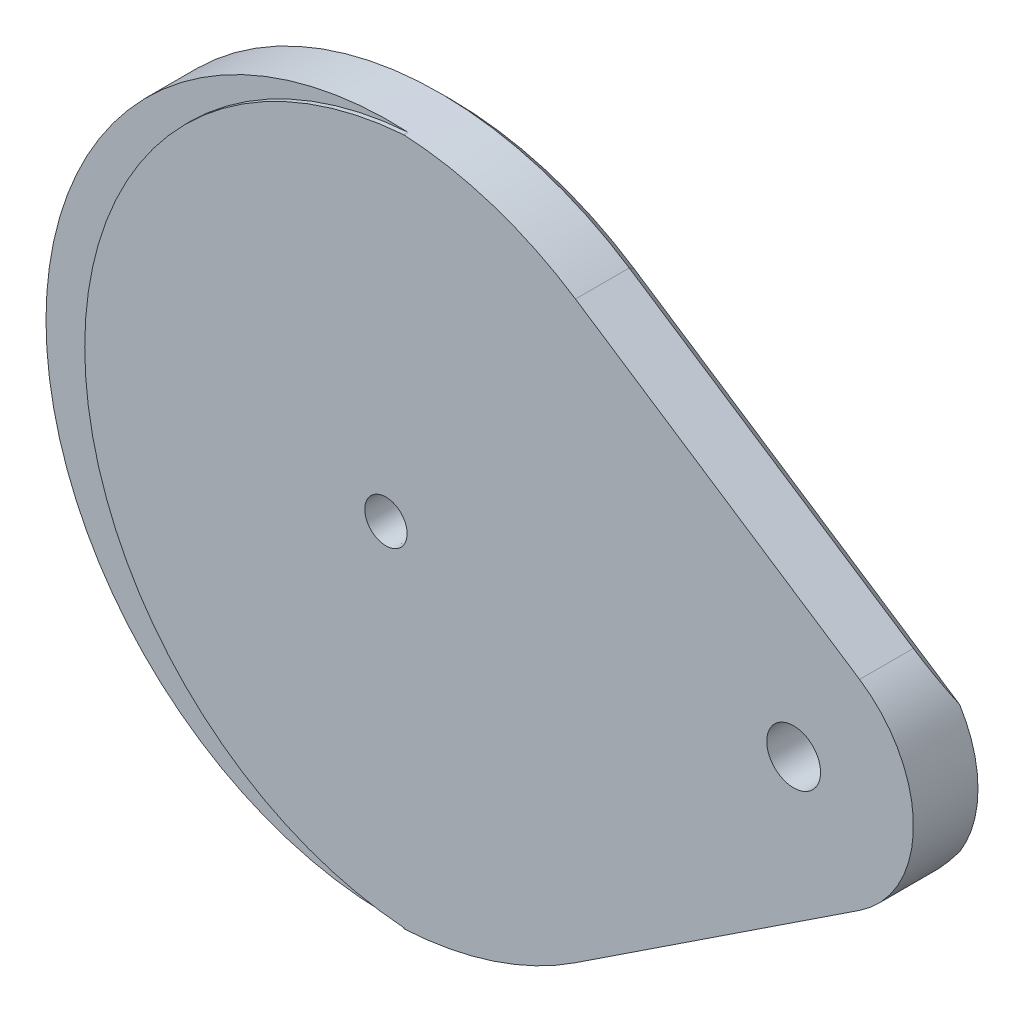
ISO-10303-21;
HEADER;
FILE_DESCRIPTION(('STEP AP214'),'2;1');
FILE_NAME('part.step','',(''),(''),'','','');
FILE_SCHEMA(('AUTOMOTIVE_DESIGN { 1 0 10303 214 1 1 1 1 }'));
ENDSEC;
DATA;
#1=APPLICATION_CONTEXT('core data for automotive mechanical design processes');
#2=APPLICATION_PROTOCOL_DEFINITION('international standard','automotive_design',2000,#1);
#3=PRODUCT_CONTEXT('',#1,'mechanical');
#4=PRODUCT('Part','Part','',(#3));
#5=PRODUCT_RELATED_PRODUCT_CATEGORY('part','',(#4));
#6=PRODUCT_DEFINITION_FORMATION('','',#4);
#7=PRODUCT_DEFINITION_CONTEXT('part definition',#1,'design');
#8=PRODUCT_DEFINITION('design','',#6,#7);
#9=PRODUCT_DEFINITION_SHAPE('','',#8);
#10=(LENGTH_UNIT() NAMED_UNIT(*) SI_UNIT(.MILLI.,.METRE.));
#11=(NAMED_UNIT(*) PLANE_ANGLE_UNIT() SI_UNIT($,.RADIAN.));
#12=(NAMED_UNIT(*) SI_UNIT($,.STERADIAN.) SOLID_ANGLE_UNIT());
#13=UNCERTAINTY_MEASURE_WITH_UNIT(LENGTH_MEASURE(1.E-05),#10,'distance_accuracy_value','');
#14=(GEOMETRIC_REPRESENTATION_CONTEXT(3) GLOBAL_UNCERTAINTY_ASSIGNED_CONTEXT((#13)) GLOBAL_UNIT_ASSIGNED_CONTEXT((#10,
#11,#12)) REPRESENTATION_CONTEXT('',''));
#15=CARTESIAN_POINT('',(0.,0.,0.));
#16=DIRECTION('',(0.,0.,1.));
#17=DIRECTION('',(1.,0.,0.));
#18=AXIS2_PLACEMENT_3D('',#15,#16,#17);
#19=CARTESIAN_POINT('',(0.,0.,0.));
#20=DIRECTION('',(0.,0.,1.));
#21=DIRECTION('',(1.,0.,0.));
#22=AXIS2_PLACEMENT_3D('',#19,#20,#21);
#23=PLANE('',#22);
#24=CARTESIAN_POINT('',(0.,0.,0.));
#25=DIRECTION('',(0.,0.,-1.));
#26=DIRECTION('',(-1.,0.,0.));
#27=AXIS2_PLACEMENT_3D('',#24,#25,#26);
#28=CIRCLE('',#27,82.55);
#29=CARTESIAN_POINT('',(-82.55,0.,0.));
#30=VERTEX_POINT('',#29);
#31=EDGE_CURVE('E378',#30,#30,#28,.T.);
#32=ORIENTED_EDGE('',*,*,#31,.F.);
#33=EDGE_LOOP('',(#32));
#34=FACE_BOUND('',#33,.T.);
#35=DIRECTION('',(0.834795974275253,0.550559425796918,0.));
#36=VECTOR('',#35,1.);
#37=CARTESIAN_POINT('',(54.1888114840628,-82.164793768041,0.));
#38=LINE('',#37,#36);
#39=CARTESIAN_POINT('',(54.1888114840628,-82.164793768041,0.));
#40=VERTEX_POINT('',#39);
#41=CARTESIAN_POINT('',(150.262212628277,-18.8030644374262,0.));
#42=VERTEX_POINT('',#41);
#43=EDGE_CURVE('E186',#40,#42,#38,.T.);
#44=ORIENTED_EDGE('',*,*,#43,.F.);
#45=CARTESIAN_POINT('',(0.,0.,0.));
#46=DIRECTION('',(0.,0.,1.));
#47=DIRECTION('',(1.,0.,0.));
#48=AXIS2_PLACEMENT_3D('',#45,#46,#47);
#49=CIRCLE('',#48,98.425);
#50=CARTESIAN_POINT('',(54.1888114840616,82.1647937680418,0.));
#51=VERTEX_POINT('',#50);
#52=EDGE_CURVE('E180',#51,#40,#49,.T.);
#53=ORIENTED_EDGE('',*,*,#52,.F.);
#54=DIRECTION('',(0.834795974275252,-0.550559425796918,0.));
#55=VECTOR('',#54,1.);
#56=CARTESIAN_POINT('',(165.35578994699,8.8486426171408,0.));
#57=LINE('',#56,#55);
#58=CARTESIAN_POINT('',(150.262212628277,18.8030644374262,0.));
#59=VERTEX_POINT('',#58);
#60=EDGE_CURVE('E165',#51,#59,#57,.T.);
#61=ORIENTED_EDGE('',*,*,#60,.T.);
#62=CARTESIAN_POINT('',(120.3198,0.,0.));
#63=DIRECTION('',(0.,0.,1.));
#64=DIRECTION('',(1.,0.,0.));
#65=AXIS2_PLACEMENT_3D('',#62,#63,#64);
#66=CIRCLE('',#65,35.3568);
#67=EDGE_CURVE('E225',#42,#59,#66,.T.);
#68=ORIENTED_EDGE('',*,*,#67,.F.);
#69=EDGE_LOOP('',(#44,#53,#61,#68));
#70=FACE_BOUND('',#69,.T.);
#71=DIRECTION('',(0.,1.,0.));
#72=VECTOR('',#71,1.);
#73=CARTESIAN_POINT('',(123.4948,-22.225,0.));
#74=LINE('',#73,#72);
#75=CARTESIAN_POINT('',(123.4948,19.05,0.));
#76=VERTEX_POINT('',#75);
#77=CARTESIAN_POINT('',(123.4948,7.27483891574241,0.));
#78=VERTEX_POINT('',#77);
#79=EDGE_CURVE('E64',#76,#78,#74,.F.);
#80=ORIENTED_EDGE('',*,*,#79,.F.);
#81=CARTESIAN_POINT('',(120.3198,19.05,0.));
#82=DIRECTION('',(0.,0.,1.));
#83=DIRECTION('',(1.,0.,0.));
#84=AXIS2_PLACEMENT_3D('',#81,#82,#83);
#85=CIRCLE('',#84,3.175);
#86=CARTESIAN_POINT('',(117.1448,19.05,0.));
#87=VERTEX_POINT('',#86);
#88=EDGE_CURVE('E11',#76,#87,#85,.T.);
#89=ORIENTED_EDGE('',*,*,#88,.T.);
#90=DIRECTION('',(0.,1.,0.));
#91=VECTOR('',#90,1.);
#92=CARTESIAN_POINT('',(117.1448,-22.225,0.));
#93=LINE('',#92,#91);
#94=CARTESIAN_POINT('',(117.1448,7.27483891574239,0.));
#95=VERTEX_POINT('',#94);
#96=EDGE_CURVE('E154',#95,#87,#93,.T.);
#97=ORIENTED_EDGE('',*,*,#96,.F.);
#98=CARTESIAN_POINT('',(120.3198,0.,0.));
#99=DIRECTION('',(0.,0.,1.));
#100=DIRECTION('',(1.,0.,0.));
#101=AXIS2_PLACEMENT_3D('',#98,#99,#100);
#102=CIRCLE('',#101,7.93750000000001);
#103=CARTESIAN_POINT('',(117.1448,-7.27483891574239,0.));
#104=VERTEX_POINT('',#103);
#105=EDGE_CURVE('E221',#95,#104,#102,.T.);
#106=ORIENTED_EDGE('',*,*,#105,.T.);
#107=CARTESIAN_POINT('',(117.1448,-19.05,0.));
#108=VERTEX_POINT('',#107);
#109=EDGE_CURVE('E56',#108,#104,#93,.T.);
#110=ORIENTED_EDGE('',*,*,#109,.F.);
#111=CARTESIAN_POINT('',(120.3198,-19.05,0.));
#112=DIRECTION('',(0.,0.,1.));
#113=DIRECTION('',(1.,0.,0.));
#114=AXIS2_PLACEMENT_3D('',#111,#112,#113);
#115=CIRCLE('',#114,3.175);
#116=CARTESIAN_POINT('',(123.4948,-19.05,0.));
#117=VERTEX_POINT('',#116);
#118=EDGE_CURVE('E49',#108,#117,#115,.T.);
#119=ORIENTED_EDGE('',*,*,#118,.T.);
#120=CARTESIAN_POINT('',(123.4948,-7.27483891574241,0.));
#121=VERTEX_POINT('',#120);
#122=EDGE_CURVE('E162',#121,#117,#74,.F.);
#123=ORIENTED_EDGE('',*,*,#122,.F.);
#124=EDGE_CURVE('E160',#121,#78,#102,.T.);
#125=ORIENTED_EDGE('',*,*,#124,.T.);
#126=EDGE_LOOP('',(#80,#89,#97,#106,#110,#119,#123,#125));
#127=FACE_BOUND('',#126,.T.);
#128=ADVANCED_FACE('F40',(#34,#70,#127),#23,.F.);
#129=CARTESIAN_POINT('',(120.3198,0.,19.05));
#130=DIRECTION('',(0.,0.,-1.));
#131=DIRECTION('',(-1.,0.,0.));
#132=AXIS2_PLACEMENT_3D('',#129,#130,#131);
#133=CYLINDRICAL_SURFACE('',#132,7.93750000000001);
#134=CARTESIAN_POINT('',(120.3198,0.,19.05));
#135=DIRECTION('',(0.,0.,1.));
#136=DIRECTION('',(1.,0.,0.));
#137=AXIS2_PLACEMENT_3D('',#134,#135,#136);
#138=CIRCLE('',#137,7.93750000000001);
#139=CARTESIAN_POINT('',(128.2573,0.,19.05));
#140=VERTEX_POINT('',#139);
#141=EDGE_CURVE('E222',#140,#140,#138,.T.);
#142=ORIENTED_EDGE('',*,*,#141,.T.);
#143=EDGE_LOOP('',(#142));
#144=FACE_BOUND('',#143,.T.);
#145=ORIENTED_EDGE('',*,*,#124,.F.);
#146=CARTESIAN_POINT('',(123.4948,-7.27483891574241,0.));
#147=CARTESIAN_POINT('',(123.494812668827,-7.27482137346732,0.0854167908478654));
#148=CARTESIAN_POINT('',(123.491353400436,-7.27634285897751,0.170823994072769));
#149=CARTESIAN_POINT('',(123.477590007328,-7.28233280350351,0.340949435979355));
#150=CARTESIAN_POINT('',(123.467288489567,-7.28680014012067,0.425667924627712));
#151=CARTESIAN_POINT('',(123.439993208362,-7.29852780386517,0.593481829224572));
#152=CARTESIAN_POINT('',(123.423025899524,-7.30577708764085,0.676582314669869));
#153=CARTESIAN_POINT('',(123.382589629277,-7.32282084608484,0.840899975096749));
#154=CARTESIAN_POINT('',(123.359120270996,-7.33261547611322,0.922117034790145));
#155=CARTESIAN_POINT('',(123.279328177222,-7.36535374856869,1.16194816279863));
#156=CARTESIAN_POINT('',(123.213566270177,-7.39167700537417,1.31707609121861));
#157=CARTESIAN_POINT('',(123.059002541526,-7.45033388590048,1.61416298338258));
#158=CARTESIAN_POINT('',(122.97017881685,-7.48267321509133,1.75610925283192));
#159=CARTESIAN_POINT('',(122.766642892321,-7.55175336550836,2.03082905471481));
#160=CARTESIAN_POINT('',(122.65083600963,-7.58863489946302,2.16275795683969));
#161=CARTESIAN_POINT('',(122.398943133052,-7.66147804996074,2.40592018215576));
#162=CARTESIAN_POINT('',(122.262852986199,-7.6974394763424,2.51714925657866));
#163=CARTESIAN_POINT('',(121.967634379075,-7.76610424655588,2.72003265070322));
#164=CARTESIAN_POINT('',(121.807808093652,-7.79862271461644,2.81073988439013));
#165=CARTESIAN_POINT('',(121.473633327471,-7.85501261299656,2.96361496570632));
#166=CARTESIAN_POINT('',(121.299290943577,-7.87888765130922,3.02579472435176));
#167=CARTESIAN_POINT('',(120.949985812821,-7.91429574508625,3.11680415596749));
#168=CARTESIAN_POINT('',(120.775461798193,-7.92637039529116,3.14710278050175));
#169=CARTESIAN_POINT('',(120.423413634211,-7.93877492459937,3.17822021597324));
#170=CARTESIAN_POINT('',(120.245890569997,-7.93910896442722,3.17904947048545));
#171=CARTESIAN_POINT('',(119.90350451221,-7.9283236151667,3.15200847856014));
#172=CARTESIAN_POINT('',(119.738490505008,-7.91784651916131,3.12574768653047));
#173=CARTESIAN_POINT('',(119.415441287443,-7.88748217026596,3.04801048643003));
#174=CARTESIAN_POINT('',(119.257406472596,-7.86759438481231,2.99653265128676));
#175=CARTESIAN_POINT('',(118.949950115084,-7.81997467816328,2.86918968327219));
#176=CARTESIAN_POINT('',(118.800694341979,-7.7921290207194,2.7929685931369));
#177=CARTESIAN_POINT('',(118.51670579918,-7.73135683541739,2.61863820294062));
#178=CARTESIAN_POINT('',(118.381978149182,-7.69842852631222,2.52052122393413));
#179=CARTESIAN_POINT('',(118.121487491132,-7.62828318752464,2.29767442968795));
#180=CARTESIAN_POINT('',(117.996891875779,-7.59092651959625,2.17162128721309));
#181=CARTESIAN_POINT('',(117.770119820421,-7.51779639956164,1.90028038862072));
#182=CARTESIAN_POINT('',(117.667953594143,-7.48202367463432,1.75498391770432));
#183=CARTESIAN_POINT('',(117.486203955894,-7.41514238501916,1.44383497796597));
#184=CARTESIAN_POINT('',(117.407354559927,-7.3841975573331,1.27751148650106));
#185=CARTESIAN_POINT('',(117.311344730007,-7.34535742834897,1.01897061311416));
#186=CARTESIAN_POINT('',(117.28305640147,-7.33367552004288,0.931303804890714));
#187=CARTESIAN_POINT('',(117.234141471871,-7.31322917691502,0.753538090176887));
#188=CARTESIAN_POINT('',(117.213511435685,-7.3044634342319,0.66344029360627));
#189=CARTESIAN_POINT('',(117.179569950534,-7.28994070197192,0.478275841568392));
#190=CARTESIAN_POINT('',(117.166547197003,-7.28430276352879,0.38314681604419));
#191=CARTESIAN_POINT('',(117.149154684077,-7.27673901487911,0.192016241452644));
#192=CARTESIAN_POINT('',(117.144779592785,-7.27481091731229,0.0960152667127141));
#193=CARTESIAN_POINT('',(117.1448,-7.27483891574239,0.));
#194=B_SPLINE_CURVE_WITH_KNOTS('',3,(#146,#147,#148,#149,#150,#151,#152,#153,#154,#155,#156,
#157,#158,#159,#160,#161,#162,#163,#164,#165,#166,#167,#168,#169,#170,#171,#172,#173,#174,#175,
#176,#177,#178,#179,#180,#181,#182,#183,#184,#185,#186,#187,#188,#189,#190,#191,#192,#193),
.UNSPECIFIED.,.F.,.F.,(4,2,2,2,2,2,2,2,2,2,2,2,2,2,2,2,2,2,2,2,2,2,2,4),(0.,0.256150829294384,
0.512204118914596,0.767251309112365,1.02231407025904,1.53143426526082,2.0410397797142,
2.57679901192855,3.11266809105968,3.66971038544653,4.22651988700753,4.75637028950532,
5.28603291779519,5.78594402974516,6.28588343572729,6.79335980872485,7.30101443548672,
7.84196226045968,8.3831559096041,8.93991483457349,9.21815697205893,9.49627415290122,
9.78435582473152,10.072259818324),.UNSPECIFIED.);
#195=EDGE_CURVE('E266',#121,#104,#194,.T.);
#196=ORIENTED_EDGE('',*,*,#195,.T.);
#197=ORIENTED_EDGE('',*,*,#105,.F.);
#198=CARTESIAN_POINT('',(117.1448,7.27483891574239,0.));
#199=CARTESIAN_POINT('',(117.144787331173,7.27482137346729,0.0854167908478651));
#200=CARTESIAN_POINT('',(117.148246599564,7.27634285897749,0.170823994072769));
#201=CARTESIAN_POINT('',(117.162009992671,7.28233280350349,0.340949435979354));
#202=CARTESIAN_POINT('',(117.172311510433,7.28680014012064,0.425667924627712));
#203=CARTESIAN_POINT('',(117.199606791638,7.29852780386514,0.593481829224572));
#204=CARTESIAN_POINT('',(117.216574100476,7.30577708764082,0.676582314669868));
#205=CARTESIAN_POINT('',(117.257010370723,7.32282084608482,0.840899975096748));
#206=CARTESIAN_POINT('',(117.280479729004,7.3326154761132,0.922117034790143));
#207=CARTESIAN_POINT('',(117.360271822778,7.36535374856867,1.16194816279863));
#208=CARTESIAN_POINT('',(117.426033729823,7.39167700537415,1.31707609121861));
#209=CARTESIAN_POINT('',(117.580597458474,7.45033388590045,1.61416298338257));
#210=CARTESIAN_POINT('',(117.66942118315,7.48267321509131,1.75610925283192));
#211=CARTESIAN_POINT('',(117.872957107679,7.55175336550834,2.03082905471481));
#212=CARTESIAN_POINT('',(117.98876399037,7.588634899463,2.16275795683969));
#213=CARTESIAN_POINT('',(118.240656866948,7.66147804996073,2.40592018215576));
#214=CARTESIAN_POINT('',(118.376747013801,7.69743947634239,2.51714925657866));
#215=CARTESIAN_POINT('',(118.671965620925,7.76610424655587,2.72003265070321));
#216=CARTESIAN_POINT('',(118.831791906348,7.79862271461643,2.81073988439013));
#217=CARTESIAN_POINT('',(119.165966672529,7.85501261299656,2.96361496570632));
#218=CARTESIAN_POINT('',(119.340309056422,7.87888765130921,3.02579472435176));
#219=CARTESIAN_POINT('',(119.689614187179,7.91429574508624,3.11680415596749));
#220=CARTESIAN_POINT('',(119.864138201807,7.92637039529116,3.14710278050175));
#221=CARTESIAN_POINT('',(120.216186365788,7.93877492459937,3.17822021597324));
#222=CARTESIAN_POINT('',(120.393709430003,7.93910896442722,3.17904947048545));
#223=CARTESIAN_POINT('',(120.73609548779,7.9283236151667,3.15200847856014));
#224=CARTESIAN_POINT('',(120.901109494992,7.91784651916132,3.12574768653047));
#225=CARTESIAN_POINT('',(121.224158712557,7.88748217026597,3.04801048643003));
#226=CARTESIAN_POINT('',(121.382193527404,7.86759438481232,2.99653265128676));
#227=CARTESIAN_POINT('',(121.689649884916,7.81997467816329,2.86918968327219));
#228=CARTESIAN_POINT('',(121.838905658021,7.79212902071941,2.79296859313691));
#229=CARTESIAN_POINT('',(122.12289420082,7.73135683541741,2.61863820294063));
#230=CARTESIAN_POINT('',(122.257621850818,7.69842852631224,2.52052122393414));
#231=CARTESIAN_POINT('',(122.518112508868,7.62828318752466,2.29767442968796));
#232=CARTESIAN_POINT('',(122.642708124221,7.59092651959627,2.1716212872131));
#233=CARTESIAN_POINT('',(122.869480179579,7.51779639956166,1.90028038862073));
#234=CARTESIAN_POINT('',(122.971646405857,7.48202367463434,1.75498391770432));
#235=CARTESIAN_POINT('',(123.153396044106,7.41514238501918,1.44383497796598));
#236=CARTESIAN_POINT('',(123.232245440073,7.38419755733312,1.27751148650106));
#237=CARTESIAN_POINT('',(123.328255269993,7.34535742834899,1.01897061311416));
#238=CARTESIAN_POINT('',(123.35654359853,7.3336755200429,0.931303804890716));
#239=CARTESIAN_POINT('',(123.405458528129,7.31322917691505,0.753538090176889));
#240=CARTESIAN_POINT('',(123.426088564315,7.30446343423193,0.663440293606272));
#241=CARTESIAN_POINT('',(123.460030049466,7.28994070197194,0.478275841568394));
#242=CARTESIAN_POINT('',(123.473052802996,7.28430276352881,0.383146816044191));
#243=CARTESIAN_POINT('',(123.490445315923,7.27673901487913,0.192016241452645));
#244=CARTESIAN_POINT('',(123.494820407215,7.27481091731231,0.0960152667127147));
#245=CARTESIAN_POINT('',(123.4948,7.27483891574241,0.));
#246=B_SPLINE_CURVE_WITH_KNOTS('',3,(#198,#199,#200,#201,#202,#203,#204,#205,#206,#207,#208,
#209,#210,#211,#212,#213,#214,#215,#216,#217,#218,#219,#220,#221,#222,#223,#224,#225,#226,#227,
#228,#229,#230,#231,#232,#233,#234,#235,#236,#237,#238,#239,#240,#241,#242,#243,#244,#245),
.UNSPECIFIED.,.F.,.F.,(4,2,2,2,2,2,2,2,2,2,2,2,2,2,2,2,2,2,2,2,2,2,2,4),(0.,0.256150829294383,
0.512204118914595,0.767251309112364,1.02231407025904,1.53143426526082,2.04103977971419,
2.57679901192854,3.11266809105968,3.66971038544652,4.22651988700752,4.75637028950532,
5.28603291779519,5.78594402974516,6.2858834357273,6.79335980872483,7.30101443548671,
7.84196226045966,8.38315590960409,8.93991483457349,9.21815697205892,9.49627415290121,
9.78435582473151,10.072259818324),.UNSPECIFIED.);
#247=EDGE_CURVE('E259',#95,#78,#246,.T.);
#248=ORIENTED_EDGE('',*,*,#247,.T.);
#249=EDGE_LOOP('',(#145,#196,#197,#248));
#250=FACE_BOUND('',#249,.T.);
#251=ADVANCED_FACE('F271',(#144,#250),#133,.F.);
#252=CARTESIAN_POINT('',(120.3198,0.,19.05));
#253=DIRECTION('',(0.,0.,-1.));
#254=DIRECTION('',(-1.,0.,0.));
#255=AXIS2_PLACEMENT_3D('',#252,#253,#254);
#256=CYLINDRICAL_SURFACE('',#255,35.3568);
#257=CARTESIAN_POINT('',(120.3198,0.,-32.1818000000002));
#258=DIRECTION('',(0.389304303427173,-0.590289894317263,-0.707106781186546));
#259=DIRECTION('',(-0.389304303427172,0.590289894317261,-0.707106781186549));
#260=AXIS2_PLACEMENT_3D('',#257,#258,#259);
#261=ELLIPSE('',#260,50.0020660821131,35.3568);
#262=CARTESIAN_POINT('',(139.785819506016,-29.5157143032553,3.17500000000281));
#263=VERTEX_POINT('',#262);
#264=EDGE_CURVE('E257',#42,#263,#261,.T.);
#265=ORIENTED_EDGE('',*,*,#264,.F.);
#266=ORIENTED_EDGE('',*,*,#67,.T.);
#267=CARTESIAN_POINT('',(120.3198,0.,-32.1818000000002));
#268=DIRECTION('',(-0.389304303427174,-0.590289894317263,0.707106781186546));
#269=DIRECTION('',(-0.389304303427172,-0.59028989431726,-0.707106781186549));
#270=AXIS2_PLACEMENT_3D('',#267,#268,#269);
#271=ELLIPSE('',#270,50.0020660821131,35.3568);
#272=CARTESIAN_POINT('',(139.785819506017,29.5157143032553,3.17500000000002));
#273=VERTEX_POINT('',#272);
#274=EDGE_CURVE('E191',#59,#273,#271,.T.);
#275=ORIENTED_EDGE('',*,*,#274,.T.);
#276=DIRECTION('',(0.,0.,-1.));
#277=VECTOR('',#276,1.);
#278=CARTESIAN_POINT('',(139.785819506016,29.5157143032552,19.05));
#279=LINE('',#278,#277);
#280=CARTESIAN_POINT('',(139.785819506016,29.5157143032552,19.05));
#281=VERTEX_POINT('',#280);
#282=EDGE_CURVE('E241',#281,#273,#279,.T.);
#283=ORIENTED_EDGE('',*,*,#282,.F.);
#284=CARTESIAN_POINT('',(120.3198,0.,19.05));
#285=DIRECTION('',(0.,0.,1.));
#286=DIRECTION('',(1.,0.,0.));
#287=AXIS2_PLACEMENT_3D('',#284,#285,#286);
#288=CIRCLE('',#287,35.3568);
#289=CARTESIAN_POINT('',(139.785819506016,-29.5157143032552,19.05));
#290=VERTEX_POINT('',#289);
#291=EDGE_CURVE('E233',#290,#281,#288,.T.);
#292=ORIENTED_EDGE('',*,*,#291,.F.);
#293=DIRECTION('',(0.,0.,-1.));
#294=VECTOR('',#293,1.);
#295=CARTESIAN_POINT('',(139.785819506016,-29.5157143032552,19.05));
#296=LINE('',#295,#294);
#297=EDGE_CURVE('E244',#290,#263,#296,.T.);
#298=ORIENTED_EDGE('',*,*,#297,.T.);
#299=EDGE_LOOP('',(#265,#266,#275,#283,#292,#298));
#300=FACE_BOUND('',#299,.T.);
#301=ADVANCED_FACE('F324',(#300),#256,.T.);
#302=CARTESIAN_POINT('',(0.,0.,19.05));
#303=DIRECTION('',(0.,0.,1.));
#304=DIRECTION('',(1.,0.,0.));
#305=AXIS2_PLACEMENT_3D('',#302,#303,#304);
#306=PLANE('',#305);
#307=CARTESIAN_POINT('',(0.,0.,19.05));
#308=DIRECTION('',(0.,0.,1.));
#309=DIRECTION('',(1.,0.,0.));
#310=AXIS2_PLACEMENT_3D('',#307,#308,#309);
#311=CIRCLE('',#310,6.244082);
#312=CARTESIAN_POINT('',(6.244082,0.,19.05));
#313=VERTEX_POINT('',#312);
#314=EDGE_CURVE('E389',#313,#313,#311,.T.);
#315=ORIENTED_EDGE('',*,*,#314,.F.);
#316=EDGE_LOOP('',(#315));
#317=FACE_BOUND('',#316,.T.);
#318=DIRECTION('',(0.,1.,0.));
#319=VECTOR('',#318,1.);
#320=CARTESIAN_POINT('',(5.27332086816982,101.460631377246,19.05));
#321=LINE('',#320,#319);
#322=CARTESIAN_POINT('',(5.27332086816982,101.460631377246,19.05));
#323=VERTEX_POINT('',#322);
#324=CARTESIAN_POINT('',(5.27332086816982,101.463057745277,19.05));
#325=VERTEX_POINT('',#324);
#326=EDGE_CURVE('E203',#323,#325,#321,.T.);
#327=ORIENTED_EDGE('',*,*,#326,.F.);
#328=CARTESIAN_POINT('',(12.7,0.132343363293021,19.05));
#329=DIRECTION('',(0.,0.,1.));
#330=DIRECTION('',(1.,0.,0.));
#331=AXIS2_PLACEMENT_3D('',#328,#329,#330);
#332=CIRCLE('',#331,101.600086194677);
#333=CARTESIAN_POINT('',(5.25951137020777,-101.194931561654,19.05));
#334=VERTEX_POINT('',#333);
#335=EDGE_CURVE('E200',#323,#334,#332,.T.);
#336=ORIENTED_EDGE('',*,*,#335,.T.);
#337=DIRECTION('',(0.0519040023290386,-0.998652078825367,0.));
#338=VECTOR('',#337,1.);
#339=CARTESIAN_POINT('',(5.25951137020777,-101.194931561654,19.05));
#340=LINE('',#339,#338);
#341=CARTESIAN_POINT('',(5.27332086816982,-101.460631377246,19.05));
#342=VERTEX_POINT('',#341);
#343=EDGE_CURVE('E197',#334,#342,#340,.T.);
#344=ORIENTED_EDGE('',*,*,#343,.T.);
#345=DIRECTION('',(0.,-1.,0.));
#346=VECTOR('',#345,1.);
#347=CARTESIAN_POINT('',(5.27332086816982,-101.460631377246,19.05));
#348=LINE('',#347,#346);
#349=CARTESIAN_POINT('',(5.27332086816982,-101.463057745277,19.05));
#350=VERTEX_POINT('',#349);
#351=EDGE_CURVE('E194',#342,#350,#348,.T.);
#352=ORIENTED_EDGE('',*,*,#351,.T.);
#353=CARTESIAN_POINT('',(0.,0.,19.05));
#354=DIRECTION('',(0.,0.,1.));
#355=DIRECTION('',(1.,0.,0.));
#356=AXIS2_PLACEMENT_3D('',#353,#354,#355);
#357=CIRCLE('',#356,101.6);
#358=CARTESIAN_POINT('',(55.9368376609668,-84.8152709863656,19.05));
#359=VERTEX_POINT('',#358);
#360=EDGE_CURVE('E227',#350,#359,#357,.T.);
#361=ORIENTED_EDGE('',*,*,#360,.T.);
#362=DIRECTION('',(0.834795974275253,0.550559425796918,0.));
#363=VECTOR('',#362,1.);
#364=CARTESIAN_POINT('',(55.9368376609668,-84.8152709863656,19.05));
#365=LINE('',#364,#363);
#366=EDGE_CURVE('E231',#359,#290,#365,.T.);
#367=ORIENTED_EDGE('',*,*,#366,.T.);
#368=ORIENTED_EDGE('',*,*,#291,.T.);
#369=DIRECTION('',(0.834795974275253,-0.550559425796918,0.));
#370=VECTOR('',#369,1.);
#371=CARTESIAN_POINT('',(55.9368376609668,84.8152709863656,19.05));
#372=LINE('',#371,#370);
#373=CARTESIAN_POINT('',(55.9368376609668,84.8152709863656,19.05));
#374=VERTEX_POINT('',#373);
#375=EDGE_CURVE('E235',#374,#281,#372,.T.);
#376=ORIENTED_EDGE('',*,*,#375,.F.);
#377=EDGE_CURVE('E228',#374,#325,#357,.T.);
#378=ORIENTED_EDGE('',*,*,#377,.T.);
#379=EDGE_LOOP('',(#327,#336,#344,#352,#361,#367,#368,#376,#378));
#380=FACE_BOUND('',#379,.T.);
#381=ORIENTED_EDGE('',*,*,#141,.F.);
#382=EDGE_LOOP('',(#381));
#383=FACE_BOUND('',#382,.T.);
#384=ADVANCED_FACE('F328',(#317,#380,#383),#306,.T.);
#385=CARTESIAN_POINT('',(0.,0.,19.05));
#386=DIRECTION('',(0.,0.,-1.));
#387=DIRECTION('',(-1.,0.,0.));
#388=AXIS2_PLACEMENT_3D('',#385,#386,#387);
#389=CYLINDRICAL_SURFACE('',#388,101.6);
#390=DIRECTION('',(0.,0.,-1.));
#391=VECTOR('',#390,1.);
#392=CARTESIAN_POINT('',(55.9368376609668,84.8152709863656,19.05));
#393=LINE('',#392,#391);
#394=CARTESIAN_POINT('',(55.9368376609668,84.8152709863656,3.17500000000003));
#395=VERTEX_POINT('',#394);
#396=EDGE_CURVE('E238',#374,#395,#393,.T.);
#397=ORIENTED_EDGE('',*,*,#396,.T.);
#398=CARTESIAN_POINT('',(0.,0.,3.17500000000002));
#399=DIRECTION('',(0.,0.,1.));
#400=DIRECTION('',(1.,0.,0.));
#401=AXIS2_PLACEMENT_3D('',#398,#399,#400);
#402=CIRCLE('',#401,101.6);
#403=CARTESIAN_POINT('',(55.936837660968,-84.8152709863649,3.17500000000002));
#404=VERTEX_POINT('',#403);
#405=EDGE_CURVE('E183',#395,#404,#402,.T.);
#406=ORIENTED_EDGE('',*,*,#405,.T.);
#407=DIRECTION('',(0.,0.,-1.));
#408=VECTOR('',#407,1.);
#409=CARTESIAN_POINT('',(55.9368376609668,-84.8152709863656,19.05));
#410=LINE('',#409,#408);
#411=EDGE_CURVE('E247',#359,#404,#410,.T.);
#412=ORIENTED_EDGE('',*,*,#411,.F.);
#413=ORIENTED_EDGE('',*,*,#360,.F.);
#414=DIRECTION('',(0.,0.,-1.));
#415=VECTOR('',#414,1.);
#416=CARTESIAN_POINT('',(5.27332086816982,-101.463057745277,19.05));
#417=LINE('',#416,#415);
#418=CARTESIAN_POINT('',(5.27332086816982,-101.463057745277,17.78));
#419=VERTEX_POINT('',#418);
#420=EDGE_CURVE('E252',#419,#350,#417,.F.);
#421=ORIENTED_EDGE('',*,*,#420,.F.);
#422=CARTESIAN_POINT('',(0.,0.,17.78));
#423=DIRECTION('',(0.,0.,1.));
#424=DIRECTION('',(1.,0.,0.));
#425=AXIS2_PLACEMENT_3D('',#422,#423,#424);
#426=CIRCLE('',#425,101.6);
#427=CARTESIAN_POINT('',(5.27332086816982,101.463057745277,17.78));
#428=VERTEX_POINT('',#427);
#429=EDGE_CURVE('E250',#428,#419,#426,.T.);
#430=ORIENTED_EDGE('',*,*,#429,.F.);
#431=DIRECTION('',(0.,0.,-1.));
#432=VECTOR('',#431,1.);
#433=CARTESIAN_POINT('',(5.27332086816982,101.463057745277,19.05));
#434=LINE('',#433,#432);
#435=EDGE_CURVE('E254',#428,#325,#434,.F.);
#436=ORIENTED_EDGE('',*,*,#435,.T.);
#437=ORIENTED_EDGE('',*,*,#377,.F.);
#438=EDGE_LOOP('',(#397,#406,#412,#413,#421,#430,#436,#437));
#439=FACE_BOUND('',#438,.T.);
#440=ADVANCED_FACE('F42',(#439),#389,.T.);
#441=CARTESIAN_POINT('',(55.9368376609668,-84.8152709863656,19.05));
#442=DIRECTION('',(-0.550559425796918,0.834795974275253,0.));
#443=DIRECTION('',(-0.834795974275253,-0.550559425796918,0.));
#444=AXIS2_PLACEMENT_3D('',#441,#442,#443);
#445=PLANE('',#444);
#446=ORIENTED_EDGE('',*,*,#411,.T.);
#447=DIRECTION('',(0.834795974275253,0.550559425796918,0.));
#448=VECTOR('',#447,1.);
#449=CARTESIAN_POINT('',(55.936837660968,-84.8152709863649,3.17500000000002));
#450=LINE('',#449,#448);
#451=EDGE_CURVE('E188',#404,#263,#450,.T.);
#452=ORIENTED_EDGE('',*,*,#451,.T.);
#453=ORIENTED_EDGE('',*,*,#297,.F.);
#454=ORIENTED_EDGE('',*,*,#366,.F.);
#455=EDGE_LOOP('',(#446,#452,#453,#454));
#456=FACE_BOUND('',#455,.T.);
#457=ADVANCED_FACE('F334',(#456),#445,.F.);
#458=CARTESIAN_POINT('',(55.9368376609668,84.8152709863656,19.05));
#459=DIRECTION('',(0.550559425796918,0.834795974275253,0.));
#460=DIRECTION('',(-0.834795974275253,0.550559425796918,0.));
#461=AXIS2_PLACEMENT_3D('',#458,#459,#460);
#462=PLANE('',#461);
#463=DIRECTION('',(0.834795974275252,-0.550559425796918,0.));
#464=VECTOR('',#463,1.);
#465=CARTESIAN_POINT('',(167.103816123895,11.4991198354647,3.17500000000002));
#466=LINE('',#465,#464);
#467=EDGE_CURVE('E168',#395,#273,#466,.T.);
#468=ORIENTED_EDGE('',*,*,#467,.F.);
#469=ORIENTED_EDGE('',*,*,#396,.F.);
#470=ORIENTED_EDGE('',*,*,#375,.T.);
#471=ORIENTED_EDGE('',*,*,#282,.T.);
#472=EDGE_LOOP('',(#468,#469,#470,#471));
#473=FACE_BOUND('',#472,.T.);
#474=ADVANCED_FACE('F308',(#473),#462,.T.);
#475=CARTESIAN_POINT('',(5.27332086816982,101.460631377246,17.78));
#476=DIRECTION('',(1.,0.,0.));
#477=DIRECTION('',(0.,0.,-1.));
#478=AXIS2_PLACEMENT_3D('',#475,#476,#477);
#479=PLANE('',#478);
#480=DIRECTION('',(0.,1.,0.));
#481=VECTOR('',#480,1.);
#482=CARTESIAN_POINT('',(5.27332086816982,101.460631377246,17.78));
#483=LINE('',#482,#481);
#484=CARTESIAN_POINT('',(5.27332086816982,101.460631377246,17.78));
#485=VERTEX_POINT('',#484);
#486=EDGE_CURVE('E212',#485,#428,#483,.T.);
#487=ORIENTED_EDGE('',*,*,#486,.F.);
#488=DIRECTION('',(0.,0.,1.));
#489=VECTOR('',#488,1.);
#490=CARTESIAN_POINT('',(5.27332086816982,101.460631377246,17.78));
#491=LINE('',#490,#489);
#492=EDGE_CURVE('E215',#485,#323,#491,.T.);
#493=ORIENTED_EDGE('',*,*,#492,.T.);
#494=ORIENTED_EDGE('',*,*,#326,.T.);
#495=ORIENTED_EDGE('',*,*,#435,.F.);
#496=EDGE_LOOP('',(#487,#493,#494,#495));
#497=FACE_BOUND('',#496,.T.);
#498=ADVANCED_FACE('F305',(#497),#479,.F.);
#499=CARTESIAN_POINT('',(5.27332086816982,-101.460631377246,17.78));
#500=DIRECTION('',(-1.,0.,0.));
#501=DIRECTION('',(0.,0.,1.));
#502=AXIS2_PLACEMENT_3D('',#499,#500,#501);
#503=PLANE('',#502);
#504=ORIENTED_EDGE('',*,*,#420,.T.);
#505=ORIENTED_EDGE('',*,*,#351,.F.);
#506=DIRECTION('',(0.,0.,1.));
#507=VECTOR('',#506,1.);
#508=CARTESIAN_POINT('',(5.27332086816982,-101.460631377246,17.78));
#509=LINE('',#508,#507);
#510=CARTESIAN_POINT('',(5.27332086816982,-101.460631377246,17.78));
#511=VERTEX_POINT('',#510);
#512=EDGE_CURVE('E214',#511,#342,#509,.T.);
#513=ORIENTED_EDGE('',*,*,#512,.F.);
#514=DIRECTION('',(0.,-1.,0.));
#515=VECTOR('',#514,1.);
#516=CARTESIAN_POINT('',(5.27332086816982,-101.460631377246,17.78));
#517=LINE('',#516,#515);
#518=EDGE_CURVE('E205',#511,#419,#517,.T.);
#519=ORIENTED_EDGE('',*,*,#518,.T.);
#520=EDGE_LOOP('',(#504,#505,#513,#519));
#521=FACE_BOUND('',#520,.T.);
#522=ADVANCED_FACE('F303',(#521),#503,.T.);
#523=CARTESIAN_POINT('',(0.,0.,17.78));
#524=DIRECTION('',(0.,0.,1.));
#525=DIRECTION('',(1.,0.,0.));
#526=AXIS2_PLACEMENT_3D('',#523,#524,#525);
#527=PLANE('',#526);
#528=ORIENTED_EDGE('',*,*,#429,.T.);
#529=ORIENTED_EDGE('',*,*,#518,.F.);
#530=DIRECTION('',(0.0519040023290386,-0.998652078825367,0.));
#531=VECTOR('',#530,1.);
#532=CARTESIAN_POINT('',(5.25951137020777,-101.194931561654,17.78));
#533=LINE('',#532,#531);
#534=CARTESIAN_POINT('',(5.25951137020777,-101.194931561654,17.78));
#535=VERTEX_POINT('',#534);
#536=EDGE_CURVE('E208',#535,#511,#533,.T.);
#537=ORIENTED_EDGE('',*,*,#536,.F.);
#538=CARTESIAN_POINT('',(12.7,0.132343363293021,17.78));
#539=DIRECTION('',(0.,0.,1.));
#540=DIRECTION('',(1.,0.,0.));
#541=AXIS2_PLACEMENT_3D('',#538,#539,#540);
#542=CIRCLE('',#541,101.600086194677);
#543=EDGE_CURVE('E210',#485,#535,#542,.T.);
#544=ORIENTED_EDGE('',*,*,#543,.F.);
#545=ORIENTED_EDGE('',*,*,#486,.T.);
#546=EDGE_LOOP('',(#528,#529,#537,#544,#545));
#547=FACE_BOUND('',#546,.T.);
#548=ADVANCED_FACE('F299',(#547),#527,.T.);
#549=CARTESIAN_POINT('',(12.7,0.132343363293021,17.78));
#550=DIRECTION('',(0.,0.,1.));
#551=DIRECTION('',(1.,0.,0.));
#552=AXIS2_PLACEMENT_3D('',#549,#550,#551);
#553=CYLINDRICAL_SURFACE('',#552,101.600086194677);
#554=ORIENTED_EDGE('',*,*,#335,.F.);
#555=ORIENTED_EDGE('',*,*,#492,.F.);
#556=ORIENTED_EDGE('',*,*,#543,.T.);
#557=DIRECTION('',(0.,0.,1.));
#558=VECTOR('',#557,1.);
#559=CARTESIAN_POINT('',(5.25951137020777,-101.194931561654,17.78));
#560=LINE('',#559,#558);
#561=EDGE_CURVE('E217',#535,#334,#560,.T.);
#562=ORIENTED_EDGE('',*,*,#561,.T.);
#563=EDGE_LOOP('',(#554,#555,#556,#562));
#564=FACE_BOUND('',#563,.T.);
#565=ADVANCED_FACE('F302',(#564),#553,.T.);
#566=CARTESIAN_POINT('',(5.25951137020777,-101.194931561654,17.78));
#567=DIRECTION('',(-0.998652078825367,-0.0519040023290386,0.));
#568=DIRECTION('',(0.0519040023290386,-0.998652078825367,0.));
#569=AXIS2_PLACEMENT_3D('',#566,#567,#568);
#570=PLANE('',#569);
#571=ORIENTED_EDGE('',*,*,#343,.F.);
#572=ORIENTED_EDGE('',*,*,#561,.F.);
#573=ORIENTED_EDGE('',*,*,#536,.T.);
#574=ORIENTED_EDGE('',*,*,#512,.T.);
#575=EDGE_LOOP('',(#571,#572,#573,#574));
#576=FACE_BOUND('',#575,.T.);
#577=ADVANCED_FACE('F297',(#576),#570,.T.);
#578=CARTESIAN_POINT('',(55.936837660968,-84.8152709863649,3.17500000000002));
#579=DIRECTION('',(0.389304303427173,-0.590289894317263,-0.707106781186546));
#580=DIRECTION('',(0.,0.767668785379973,-0.640846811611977));
#581=AXIS2_PLACEMENT_3D('',#578,#579,#580);
#582=PLANE('',#581);
#583=ORIENTED_EDGE('',*,*,#264,.T.);
#584=ORIENTED_EDGE('',*,*,#451,.F.);
#585=DIRECTION('',(-0.389304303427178,0.590289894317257,-0.707106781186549));
#586=VECTOR('',#585,1.);
#587=CARTESIAN_POINT('',(55.936837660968,-84.8152709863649,3.17500000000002));
#588=LINE('',#587,#586);
#589=EDGE_CURVE('E178',#404,#40,#588,.T.);
#590=ORIENTED_EDGE('',*,*,#589,.T.);
#591=ORIENTED_EDGE('',*,*,#43,.T.);
#592=EDGE_LOOP('',(#583,#584,#590,#591));
#593=FACE_BOUND('',#592,.T.);
#594=ADVANCED_FACE('F290',(#593),#582,.T.);
#595=CARTESIAN_POINT('',(167.103816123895,11.4991198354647,3.17500000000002));
#596=DIRECTION('',(-0.389304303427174,-0.590289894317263,0.707106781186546));
#597=DIRECTION('',(0.,-0.767668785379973,-0.640846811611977));
#598=AXIS2_PLACEMENT_3D('',#595,#596,#597);
#599=PLANE('',#598);
#600=ORIENTED_EDGE('',*,*,#60,.F.);
#601=DIRECTION('',(-0.389304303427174,-0.590289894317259,-0.707106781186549));
#602=VECTOR('',#601,1.);
#603=CARTESIAN_POINT('',(55.9368376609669,84.8152709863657,3.17500000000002));
#604=LINE('',#603,#602);
#605=EDGE_CURVE('E174',#395,#51,#604,.T.);
#606=ORIENTED_EDGE('',*,*,#605,.F.);
#607=ORIENTED_EDGE('',*,*,#467,.T.);
#608=ORIENTED_EDGE('',*,*,#274,.F.);
#609=EDGE_LOOP('',(#600,#606,#607,#608));
#610=FACE_BOUND('',#609,.T.);
#611=ADVANCED_FACE('F286',(#610),#599,.F.);
#612=CARTESIAN_POINT('',(0.,0.,3.17500000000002));
#613=DIRECTION('',(0.,0.,1.));
#614=DIRECTION('',(1.,0.,0.));
#615=AXIS2_PLACEMENT_3D('',#612,#613,#614);
#616=CONICAL_SURFACE('',#615,101.6,0.785398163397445);
#617=ORIENTED_EDGE('',*,*,#605,.T.);
#618=ORIENTED_EDGE('',*,*,#52,.T.);
#619=ORIENTED_EDGE('',*,*,#589,.F.);
#620=ORIENTED_EDGE('',*,*,#405,.F.);
#621=EDGE_LOOP('',(#617,#618,#619,#620));
#622=FACE_BOUND('',#621,.T.);
#623=ADVANCED_FACE('F289',(#622),#616,.T.);
#624=CARTESIAN_POINT('',(120.3198,-22.225,0.));
#625=DIRECTION('',(0.,1.,0.));
#626=DIRECTION('',(0.,0.,1.));
#627=AXIS2_PLACEMENT_3D('',#624,#625,#626);
#628=CYLINDRICAL_SURFACE('',#627,3.17500000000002);
#629=ORIENTED_EDGE('',*,*,#79,.T.);
#630=ORIENTED_EDGE('',*,*,#247,.F.);
#631=ORIENTED_EDGE('',*,*,#96,.T.);
#632=CARTESIAN_POINT('',(120.3198,19.05,0.));
#633=DIRECTION('',(0.,1.,0.));
#634=DIRECTION('',(0.,0.,1.));
#635=AXIS2_PLACEMENT_3D('',#632,#633,#634);
#636=CIRCLE('',#635,3.17500000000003);
#637=EDGE_CURVE('E150',#87,#76,#636,.T.);
#638=ORIENTED_EDGE('',*,*,#637,.T.);
#639=EDGE_LOOP('',(#629,#630,#631,#638));
#640=FACE_BOUND('',#639,.T.);
#641=ADVANCED_FACE('F153',(#640),#628,.F.);
#642=CARTESIAN_POINT('',(120.3198,19.05,0.));
#643=DIRECTION('',(0.,1.,0.));
#644=DIRECTION('',(-1.,0.,0.));
#645=AXIS2_PLACEMENT_3D('',#642,#643,#644);
#646=SPHERICAL_SURFACE('',#645,3.175);
#647=ORIENTED_EDGE('',*,*,#637,.F.);
#648=ORIENTED_EDGE('',*,*,#88,.F.);
#649=EDGE_LOOP('',(#647,#648));
#650=FACE_BOUND('',#649,.T.);
#651=ADVANCED_FACE('F149',(#650),#646,.F.);
#652=CARTESIAN_POINT('',(120.3198,-19.05,0.));
#653=DIRECTION('',(0.,1.,0.));
#654=DIRECTION('',(1.,0.,0.));
#655=AXIS2_PLACEMENT_3D('',#652,#653,#654);
#656=SPHERICAL_SURFACE('',#655,3.175);
#657=CARTESIAN_POINT('',(120.3198,-19.05,0.));
#658=DIRECTION('',(0.,1.,0.));
#659=DIRECTION('',(0.,0.,1.));
#660=AXIS2_PLACEMENT_3D('',#657,#658,#659);
#661=CIRCLE('',#660,3.17500000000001);
#662=EDGE_CURVE('E155',#108,#117,#661,.T.);
#663=ORIENTED_EDGE('',*,*,#662,.T.);
#664=ORIENTED_EDGE('',*,*,#118,.F.);
#665=EDGE_LOOP('',(#663,#664));
#666=FACE_BOUND('',#665,.T.);
#667=ADVANCED_FACE('F281',(#666),#656,.F.);
#668=ORIENTED_EDGE('',*,*,#122,.T.);
#669=ORIENTED_EDGE('',*,*,#662,.F.);
#670=ORIENTED_EDGE('',*,*,#109,.T.);
#671=ORIENTED_EDGE('',*,*,#195,.F.);
#672=EDGE_LOOP('',(#668,#669,#670,#671));
#673=FACE_BOUND('',#672,.T.);
#674=ADVANCED_FACE('F275',(#673),#628,.F.);
#675=CARTESIAN_POINT('',(0.,0.,0.));
#676=DIRECTION('',(0.,0.,-1.));
#677=DIRECTION('',(-1.,0.,0.));
#678=AXIS2_PLACEMENT_3D('',#675,#676,#677);
#679=CONICAL_SURFACE('',#678,82.55,1.455919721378);
#680=CARTESIAN_POINT('',(0.,0.,8.88316153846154));
#681=DIRECTION('',(0.,0.,-1.));
#682=DIRECTION('',(-1.,0.,0.));
#683=AXIS2_PLACEMENT_3D('',#680,#681,#682);
#684=CIRCLE('',#683,5.5626);
#685=CARTESIAN_POINT('',(-5.56259999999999,0.,8.88316153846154));
#686=VERTEX_POINT('',#685);
#687=EDGE_CURVE('E44',#686,#686,#684,.F.);
#688=CARTESIAN_POINT('',(-5.56259999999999,0.,8.88316153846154));
#689=CARTESIAN_POINT('',(-6.36455208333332,0.,8.79062860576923));
#690=CARTESIAN_POINT('',(-7.16650416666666,0.,8.69809567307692));
#691=CARTESIAN_POINT('',(-8.77040833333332,0.,8.51302980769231));
#692=CARTESIAN_POINT('',(-9.57236041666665,0.,8.420496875));
#693=CARTESIAN_POINT('',(-11.1762645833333,0.,8.23543100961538));
#694=CARTESIAN_POINT('',(-11.9782166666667,0.,8.14289807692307));
#695=CARTESIAN_POINT('',(-13.5821208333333,0.,7.95783221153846));
#696=CARTESIAN_POINT('',(-14.3840729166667,0.,7.86529927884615));
#697=CARTESIAN_POINT('',(-15.9879770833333,0.,7.68023341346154));
#698=CARTESIAN_POINT('',(-16.7899291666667,0.,7.58770048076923));
#699=CARTESIAN_POINT('',(-18.3938333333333,0.,7.40263461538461));
#700=CARTESIAN_POINT('',(-19.1957854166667,0.,7.31010168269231));
#701=CARTESIAN_POINT('',(-20.7996895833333,0.,7.12503581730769));
#702=CARTESIAN_POINT('',(-21.6016416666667,0.,7.03250288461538));
#703=CARTESIAN_POINT('',(-23.2055458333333,0.,6.84743701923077));
#704=CARTESIAN_POINT('',(-24.0074979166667,0.,6.75490408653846));
#705=CARTESIAN_POINT('',(-25.6114020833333,0.,6.56983822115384));
#706=CARTESIAN_POINT('',(-26.4133541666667,0.,6.47730528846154));
#707=CARTESIAN_POINT('',(-28.0172583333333,0.,6.29223942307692));
#708=CARTESIAN_POINT('',(-28.8192104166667,0.,6.19970649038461));
#709=CARTESIAN_POINT('',(-30.4231145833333,0.,6.014640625));
#710=CARTESIAN_POINT('',(-31.2250666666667,0.,5.92210769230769));
#711=CARTESIAN_POINT('',(-32.8289708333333,0.,5.73704182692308));
#712=CARTESIAN_POINT('',(-33.6309229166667,0.,5.64450889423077));
#713=CARTESIAN_POINT('',(-35.2348270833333,0.,5.45944302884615));
#714=CARTESIAN_POINT('',(-36.0367791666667,0.,5.36691009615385));
#715=CARTESIAN_POINT('',(-37.6406833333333,0.,5.18184423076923));
#716=CARTESIAN_POINT('',(-38.4426354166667,0.,5.08931129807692));
#717=CARTESIAN_POINT('',(-40.0465395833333,0.,4.90424543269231));
#718=CARTESIAN_POINT('',(-40.8484916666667,0.,4.8117125));
#719=CARTESIAN_POINT('',(-42.4523958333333,0.,4.62664663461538));
#720=CARTESIAN_POINT('',(-43.2543479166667,0.,4.53411370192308));
#721=CARTESIAN_POINT('',(-44.8582520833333,0.,4.34904783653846));
#722=CARTESIAN_POINT('',(-45.6602041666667,0.,4.25651490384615));
#723=CARTESIAN_POINT('',(-47.2641083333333,0.,4.07144903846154));
#724=CARTESIAN_POINT('',(-48.0660604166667,0.,3.97891610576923));
#725=CARTESIAN_POINT('',(-49.6699645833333,0.,3.79385024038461));
#726=CARTESIAN_POINT('',(-50.4719166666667,0.,3.70131730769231));
#727=CARTESIAN_POINT('',(-52.0758208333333,0.,3.51625144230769));
#728=CARTESIAN_POINT('',(-52.8777729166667,0.,3.42371850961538));
#729=CARTESIAN_POINT('',(-54.4816770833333,0.,3.23865264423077));
#730=CARTESIAN_POINT('',(-55.2836291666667,0.,3.14611971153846));
#731=CARTESIAN_POINT('',(-56.8875333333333,0.,2.96105384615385));
#732=CARTESIAN_POINT('',(-57.6894854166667,0.,2.86852091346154));
#733=CARTESIAN_POINT('',(-59.2933895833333,0.,2.68345504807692));
#734=CARTESIAN_POINT('',(-60.0953416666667,0.,2.59092211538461));
#735=CARTESIAN_POINT('',(-61.6992458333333,0.,2.40585625));
#736=CARTESIAN_POINT('',(-62.5011979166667,0.,2.31332331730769));
#737=CARTESIAN_POINT('',(-64.1051020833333,0.,2.12825745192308));
#738=CARTESIAN_POINT('',(-64.9070541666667,0.,2.03572451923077));
#739=CARTESIAN_POINT('',(-66.5109583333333,0.,1.85065865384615));
#740=CARTESIAN_POINT('',(-67.3129104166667,0.,1.75812572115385));
#741=CARTESIAN_POINT('',(-68.9168145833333,0.,1.57305985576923));
#742=CARTESIAN_POINT('',(-69.7187666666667,0.,1.48052692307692));
#743=CARTESIAN_POINT('',(-71.3226708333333,0.,1.29546105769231));
#744=CARTESIAN_POINT('',(-72.1246229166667,0.,1.202928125));
#745=CARTESIAN_POINT('',(-73.7285270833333,0.,1.01786225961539));
#746=CARTESIAN_POINT('',(-74.5304791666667,0.,0.925329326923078));
#747=CARTESIAN_POINT('',(-76.1343833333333,0.,0.740263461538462));
#748=CARTESIAN_POINT('',(-76.9363354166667,0.,0.647730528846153));
#749=CARTESIAN_POINT('',(-78.5402395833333,0.,0.462664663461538));
#750=CARTESIAN_POINT('',(-79.3421916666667,0.,0.37013173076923));
#751=CARTESIAN_POINT('',(-80.9460958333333,0.,0.185065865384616));
#752=CARTESIAN_POINT('',(-81.7480479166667,0.,0.0925329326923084));
#753=CARTESIAN_POINT('',(-82.55,0.,0.));
#754=B_SPLINE_CURVE_WITH_KNOTS('',3,(#688,#689,#690,#691,#692,#693,#694,#695,#696,#697,#698,
#699,#700,#701,#702,#703,#704,#705,#706,#707,#708,#709,#710,#711,#712,#713,#714,#715,#716,#717,
#718,#719,#720,#721,#722,#723,#724,#725,#726,#727,#728,#729,#730,#731,#732,#733,#734,#735,#736,
#737,#738,#739,#740,#741,#742,#743,#744,#745,#746,#747,#748,#749,#750,#751,#752,#753),
.UNSPECIFIED.,.F.,.F.,(4,2,2,2,2,2,2,2,2,2,2,2,2,2,2,2,2,2,2,2,2,2,2,2,2,2,2,2,2,2,2,2,4),(0.,
2.42181861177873,4.84363722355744,7.26545583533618,9.68727444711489,12.1090930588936,
14.5309116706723,16.952730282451,19.3745488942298,21.7963675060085,24.2181861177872,
26.6400047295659,29.0618233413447,31.4836419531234,33.9054605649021,36.3272791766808,
38.7490977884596,41.1709164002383,43.592735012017,46.0145536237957,48.4363722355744,
50.8581908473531,53.2800094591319,55.7018280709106,58.1236466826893,60.545465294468,
62.9672839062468,65.3891025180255,67.8109211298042,70.2327397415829,72.6545583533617,
75.0763769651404,77.4981955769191),.UNSPECIFIED.);
#755=EDGE_CURVE('BSEAM280',#686,#30,#754,.T.);
#756=ORIENTED_EDGE('',*,*,#687,.T.);
#757=ORIENTED_EDGE('',*,*,#31,.T.);
#758=ORIENTED_EDGE('',*,*,#755,.T.);
#759=ORIENTED_EDGE('',*,*,#755,.F.);
#760=EDGE_LOOP('',(#756,#758,#757,#759));
#761=FACE_BOUND('',#760,.T.);
#762=ADVANCED_FACE('F280',(#761),#679,.F.);
#763=CARTESIAN_POINT('',(0.,0.,19.05));
#764=DIRECTION('',(0.,0.,1.));
#765=DIRECTION('',(1.,0.,0.));
#766=AXIS2_PLACEMENT_3D('',#763,#764,#765);
#767=CYLINDRICAL_SURFACE('',#766,5.5626);
#768=CARTESIAN_POINT('',(0.,0.,9.017));
#769=DIRECTION('',(0.,0.,1.));
#770=DIRECTION('',(1.,0.,0.));
#771=AXIS2_PLACEMENT_3D('',#768,#769,#770);
#772=CIRCLE('',#771,5.5626);
#773=CARTESIAN_POINT('',(5.5626,0.,9.017));
#774=VERTEX_POINT('',#773);
#775=EDGE_CURVE('E383',#774,#774,#772,.T.);
#776=ORIENTED_EDGE('',*,*,#775,.T.);
#777=EDGE_LOOP('',(#776));
#778=FACE_BOUND('',#777,.T.);
#779=ORIENTED_EDGE('',*,*,#687,.F.);
#780=EDGE_LOOP('',(#779));
#781=FACE_BOUND('',#780,.T.);
#782=ADVANCED_FACE('F401',(#778,#781),#767,.F.);
#783=CARTESIAN_POINT('',(5.5626,0.,9.017));
#784=DIRECTION('',(0.,0.,-1.));
#785=DIRECTION('',(-1.,0.,0.));
#786=AXIS2_PLACEMENT_3D('',#783,#784,#785);
#787=PLANE('',#786);
#788=ORIENTED_EDGE('',*,*,#775,.F.);
#789=EDGE_LOOP('',(#788));
#790=FACE_BOUND('',#789,.T.);
#791=CARTESIAN_POINT('',(0.,0.,9.017));
#792=DIRECTION('',(0.,0.,1.));
#793=DIRECTION('',(1.,0.,0.));
#794=AXIS2_PLACEMENT_3D('',#791,#792,#793);
#795=CIRCLE('',#794,5.94368054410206);
#796=CARTESIAN_POINT('',(5.94368054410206,0.,9.017));
#797=VERTEX_POINT('',#796);
#798=EDGE_CURVE('E386',#797,#797,#795,.T.);
#799=ORIENTED_EDGE('',*,*,#798,.T.);
#800=EDGE_LOOP('',(#799));
#801=FACE_BOUND('',#800,.T.);
#802=ADVANCED_FACE('F395',(#790,#801),#787,.F.);
#803=CARTESIAN_POINT('',(0.,0.,19.05));
#804=DIRECTION('',(0.,0.,1.));
#805=DIRECTION('',(1.,0.,0.));
#806=AXIS2_PLACEMENT_3D('',#803,#804,#805);
#807=CONICAL_SURFACE('',#806,6.244082,0.029932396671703);
#808=ORIENTED_EDGE('',*,*,#798,.F.);
#809=EDGE_LOOP('',(#808));
#810=FACE_BOUND('',#809,.T.);
#811=ORIENTED_EDGE('',*,*,#314,.T.);
#812=EDGE_LOOP('',(#811));
#813=FACE_BOUND('',#812,.T.);
#814=ADVANCED_FACE('F393',(#810,#813),#807,.F.);
#815=CLOSED_SHELL('',(#128,#251,#301,#384,#440,#457,#474,#498,#522,#548,#565,#577,#594,#611,
#623,#641,#651,#667,#674,#762,#782,#802,#814));
#816=MANIFOLD_SOLID_BREP('B2',#815);
#817=ADVANCED_BREP_SHAPE_REPRESENTATION('',(#18,#816),#14);
#818=SHAPE_DEFINITION_REPRESENTATION(#9,#817);
ENDSEC;
END-ISO-10303-21;
